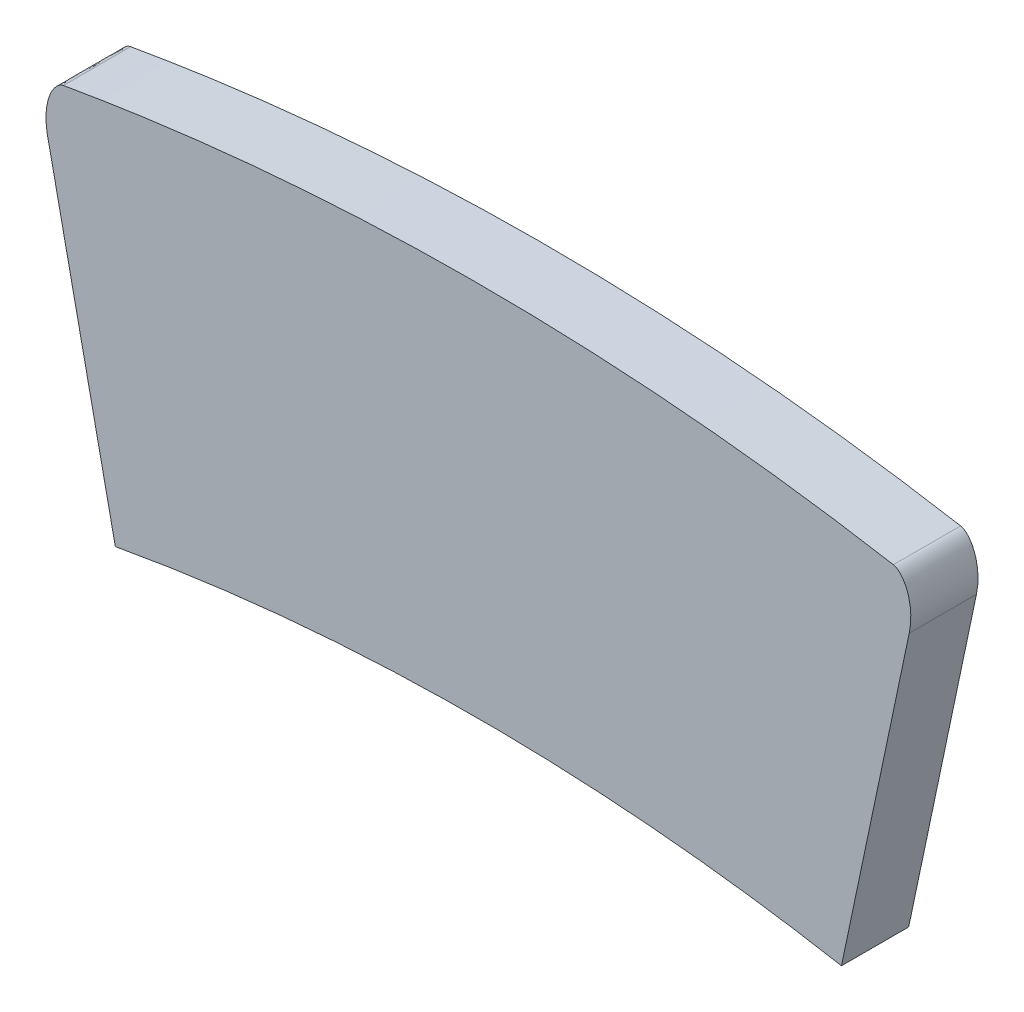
ISO-10303-21;
HEADER;
FILE_DESCRIPTION(('STEP AP214'),'2;1');
FILE_NAME('part.step','',(''),(''),'','','');
FILE_SCHEMA(('AUTOMOTIVE_DESIGN { 1 0 10303 214 1 1 1 1 }'));
ENDSEC;
DATA;
#1=APPLICATION_CONTEXT('core data for automotive mechanical design processes');
#2=APPLICATION_PROTOCOL_DEFINITION('international standard','automotive_design',2000,#1);
#3=PRODUCT_CONTEXT('',#1,'mechanical');
#4=PRODUCT('Part','Part','',(#3));
#5=PRODUCT_RELATED_PRODUCT_CATEGORY('part','',(#4));
#6=PRODUCT_DEFINITION_FORMATION('','',#4);
#7=PRODUCT_DEFINITION_CONTEXT('part definition',#1,'design');
#8=PRODUCT_DEFINITION('design','',#6,#7);
#9=PRODUCT_DEFINITION_SHAPE('','',#8);
#10=(LENGTH_UNIT() NAMED_UNIT(*) SI_UNIT(.MILLI.,.METRE.));
#11=(NAMED_UNIT(*) PLANE_ANGLE_UNIT() SI_UNIT($,.RADIAN.));
#12=(NAMED_UNIT(*) SI_UNIT($,.STERADIAN.) SOLID_ANGLE_UNIT());
#13=UNCERTAINTY_MEASURE_WITH_UNIT(LENGTH_MEASURE(1.E-05),#10,'distance_accuracy_value','');
#14=(GEOMETRIC_REPRESENTATION_CONTEXT(3) GLOBAL_UNCERTAINTY_ASSIGNED_CONTEXT((#13)) GLOBAL_UNIT_ASSIGNED_CONTEXT((#10,
#11,#12)) REPRESENTATION_CONTEXT('',''));
#15=CARTESIAN_POINT('',(0.,0.,0.));
#16=DIRECTION('',(0.,0.,1.));
#17=DIRECTION('',(1.,0.,0.));
#18=AXIS2_PLACEMENT_3D('',#15,#16,#17);
#19=CARTESIAN_POINT('',(0.618103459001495,4.44375735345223,0.8));
#20=CARTESIAN_POINT('',(-1.02369367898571,4.73126754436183,0.8));
#21=CARTESIAN_POINT('',(-2.66815252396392,4.87138414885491,0.8));
#22=CARTESIAN_POINT('',(-5.13862677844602,4.87190780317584,0.8));
#23=CARTESIAN_POINT('',(-5.96275434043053,4.836855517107,0.8));
#24=CARTESIAN_POINT('',(-7.61230750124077,4.69487139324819,0.8));
#25=CARTESIAN_POINT('',(-8.43972731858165,4.58750501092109,0.8));
#26=CARTESIAN_POINT('',(-9.2605834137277,4.44375735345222,0.8));
#27=B_SPLINE_CURVE_WITH_KNOTS('',3,(#19,#20,#21,#22,#23,#24,#25,#26),.UNSPECIFIED.,.F.,.F.,(4,2,
2,4),(0.,0.5,0.75,1.),.UNSPECIFIED.);
#28=DIRECTION('',(0.,0.,-1.));
#29=VECTOR('',#28,1.);
#30=SURFACE_OF_LINEAR_EXTRUSION('',#27,#29);
#31=CARTESIAN_POINT('',(0.618103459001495,4.44375735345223,0.));
#32=CARTESIAN_POINT('',(-1.02369367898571,4.73126754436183,0.));
#33=CARTESIAN_POINT('',(-2.66815252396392,4.87138414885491,0.));
#34=CARTESIAN_POINT('',(-5.13862677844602,4.87190780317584,0.));
#35=CARTESIAN_POINT('',(-5.96275434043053,4.836855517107,0.));
#36=CARTESIAN_POINT('',(-7.61230750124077,4.69487139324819,0.));
#37=CARTESIAN_POINT('',(-8.43972731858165,4.58750501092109,0.));
#38=CARTESIAN_POINT('',(-9.2605834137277,4.44375735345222,0.));
#39=B_SPLINE_CURVE_WITH_KNOTS('',3,(#31,#32,#33,#34,#35,#36,#37,#38),.UNSPECIFIED.,.F.,.F.,(4,2,
2,4),(0.,0.5,0.75,1.),.UNSPECIFIED.);
#40=CARTESIAN_POINT('',(0.618103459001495,4.44375735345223,0.));
#41=VERTEX_POINT('',#40);
#42=CARTESIAN_POINT('',(-9.2605834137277,4.44375735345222,0.));
#43=VERTEX_POINT('',#42);
#44=EDGE_CURVE('E89',#41,#43,#39,.T.);
#45=ORIENTED_EDGE('',*,*,#44,.T.);
#46=DIRECTION('',(0.,0.,-1.));
#47=VECTOR('',#46,1.);
#48=CARTESIAN_POINT('',(-9.2605834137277,4.44375735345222,0.8));
#49=LINE('',#48,#47);
#50=CARTESIAN_POINT('',(-9.2605834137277,4.44375735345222,0.8));
#51=VERTEX_POINT('',#50);
#52=EDGE_CURVE('E11',#51,#43,#49,.T.);
#53=ORIENTED_EDGE('',*,*,#52,.F.);
#54=CARTESIAN_POINT('',(0.618103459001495,4.44375735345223,0.8));
#55=VERTEX_POINT('',#54);
#56=EDGE_CURVE('E128',#55,#51,#27,.T.);
#57=ORIENTED_EDGE('',*,*,#56,.F.);
#58=DIRECTION('',(0.,0.,-1.));
#59=VECTOR('',#58,1.);
#60=CARTESIAN_POINT('',(0.618103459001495,4.44375735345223,0.8));
#61=LINE('',#60,#59);
#62=EDGE_CURVE('E102',#55,#41,#61,.T.);
#63=ORIENTED_EDGE('',*,*,#62,.T.);
#64=EDGE_LOOP('',(#45,#53,#57,#63));
#65=FACE_BOUND('',#64,.T.);
#66=ADVANCED_FACE('F32',(#65),#30,.F.);
#67=CARTESIAN_POINT('',(-9.2605834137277,4.44375735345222,0.8));
#68=CARTESIAN_POINT('',(-9.28960021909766,4.4386759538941,0.8));
#69=CARTESIAN_POINT('',(-9.31430015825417,4.4214263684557,0.8));
#70=CARTESIAN_POINT('',(-9.35603905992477,4.38139064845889,0.8));
#71=CARTESIAN_POINT('',(-9.37341120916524,4.35793934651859,0.8));
#72=CARTESIAN_POINT('',(-9.41786058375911,4.28408422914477,0.8));
#73=CARTESIAN_POINT('',(-9.4375241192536,4.2290328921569,0.8));
#74=CARTESIAN_POINT('',(-9.47510636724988,4.06149221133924,0.8));
#75=CARTESIAN_POINT('',(-9.47283970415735,3.94497121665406,0.8));
#76=CARTESIAN_POINT('',(-9.44906227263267,3.83200658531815,0.8));
#77=B_SPLINE_CURVE_WITH_KNOTS('',3,(#67,#68,#69,#70,#71,#72,#73,#74,#75,#76),.UNSPECIFIED.,.F.,
.F.,(4,2,2,2,4),(0.,0.125000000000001,0.250000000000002,0.500000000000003,1.),.UNSPECIFIED.);
#78=DIRECTION('',(0.,0.,-1.));
#79=VECTOR('',#78,1.);
#80=SURFACE_OF_LINEAR_EXTRUSION('',#77,#79);
#81=CARTESIAN_POINT('',(-9.2605834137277,4.44375735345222,0.));
#82=CARTESIAN_POINT('',(-9.28960021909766,4.4386759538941,0.));
#83=CARTESIAN_POINT('',(-9.31430015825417,4.4214263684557,0.));
#84=CARTESIAN_POINT('',(-9.35603905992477,4.38139064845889,0.));
#85=CARTESIAN_POINT('',(-9.37341120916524,4.35793934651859,0.));
#86=CARTESIAN_POINT('',(-9.41786058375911,4.28408422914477,0.));
#87=CARTESIAN_POINT('',(-9.4375241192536,4.2290328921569,0.));
#88=CARTESIAN_POINT('',(-9.47510636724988,4.06149221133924,0.));
#89=CARTESIAN_POINT('',(-9.47283970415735,3.94497121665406,0.));
#90=CARTESIAN_POINT('',(-9.44906227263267,3.83200658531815,0.));
#91=B_SPLINE_CURVE_WITH_KNOTS('',3,(#81,#82,#83,#84,#85,#86,#87,#88,#89,#90),.UNSPECIFIED.,.F.,
.F.,(4,2,2,2,4),(0.,0.125000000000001,0.250000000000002,0.500000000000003,1.),.UNSPECIFIED.);
#92=CARTESIAN_POINT('',(-9.44906227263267,3.83200658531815,0.));
#93=VERTEX_POINT('',#92);
#94=EDGE_CURVE('E85',#43,#93,#91,.T.);
#95=ORIENTED_EDGE('',*,*,#94,.T.);
#96=DIRECTION('',(0.,0.,-1.));
#97=VECTOR('',#96,1.);
#98=CARTESIAN_POINT('',(-9.44906227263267,3.83200658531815,0.8));
#99=LINE('',#98,#97);
#100=CARTESIAN_POINT('',(-9.44906227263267,3.83200658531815,0.8));
#101=VERTEX_POINT('',#100);
#102=EDGE_CURVE('E40',#101,#93,#99,.T.);
#103=ORIENTED_EDGE('',*,*,#102,.F.);
#104=EDGE_CURVE('E98',#51,#101,#77,.T.);
#105=ORIENTED_EDGE('',*,*,#104,.F.);
#106=ORIENTED_EDGE('',*,*,#52,.T.);
#107=EDGE_LOOP('',(#95,#103,#105,#106));
#108=FACE_BOUND('',#107,.T.);
#109=ADVANCED_FACE('F97',(#108),#80,.F.);
#110=CARTESIAN_POINT('',(-8.64247995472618,0.,0.8));
#111=DIRECTION('',(0.978557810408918,0.20597235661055,0.));
#112=DIRECTION('',(-0.20597235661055,0.978557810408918,0.));
#113=AXIS2_PLACEMENT_3D('',#110,#111,#112);
#114=PLANE('',#113);
#115=DIRECTION('',(0.20597235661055,-0.978557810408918,0.));
#116=VECTOR('',#115,1.);
#117=CARTESIAN_POINT('',(-8.64247995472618,0.,0.));
#118=LINE('',#117,#116);
#119=CARTESIAN_POINT('',(-8.64247995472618,0.,0.));
#120=VERTEX_POINT('',#119);
#121=EDGE_CURVE('E91',#93,#120,#118,.T.);
#122=ORIENTED_EDGE('',*,*,#121,.T.);
#123=DIRECTION('',(0.,0.,-1.));
#124=VECTOR('',#123,1.);
#125=CARTESIAN_POINT('',(-8.64247995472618,0.,0.8));
#126=LINE('',#125,#124);
#127=CARTESIAN_POINT('',(-8.64247995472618,0.,0.8));
#128=VERTEX_POINT('',#127);
#129=EDGE_CURVE('E242',#128,#120,#126,.T.);
#130=ORIENTED_EDGE('',*,*,#129,.F.);
#131=DIRECTION('',(0.20597235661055,-0.978557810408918,0.));
#132=VECTOR('',#131,1.);
#133=CARTESIAN_POINT('',(-8.64247995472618,0.,0.8));
#134=LINE('',#133,#132);
#135=EDGE_CURVE('E143',#101,#128,#134,.T.);
#136=ORIENTED_EDGE('',*,*,#135,.F.);
#137=ORIENTED_EDGE('',*,*,#102,.T.);
#138=EDGE_LOOP('',(#122,#130,#136,#137));
#139=FACE_BOUND('',#138,.T.);
#140=ADVANCED_FACE('F150',(#139),#114,.F.);
#141=CARTESIAN_POINT('',(-8.64247995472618,0.,0.8));
#142=CARTESIAN_POINT('',(-7.2092722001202,0.260381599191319,0.8));
#143=CARTESIAN_POINT('',(-5.77151805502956,0.387712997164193,0.8));
#144=CARTESIAN_POINT('',(-3.60838526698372,0.38844151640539,0.8));
#145=CARTESIAN_POINT('',(-2.88624821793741,0.356703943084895,0.8));
#146=CARTESIAN_POINT('',(-1.43973218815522,0.227618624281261,0.8));
#147=CARTESIAN_POINT('',(-0.716551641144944,0.130181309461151,0.8));
#148=CARTESIAN_POINT('',(0.,0.,0.8));
#149=B_SPLINE_CURVE_WITH_KNOTS('',3,(#141,#142,#143,#144,#145,#146,#147,#148),.UNSPECIFIED.,.F.,
.F.,(4,2,2,4),(0.,0.5,0.75,1.),.UNSPECIFIED.);
#150=DIRECTION('',(0.,0.,-1.));
#151=VECTOR('',#150,1.);
#152=SURFACE_OF_LINEAR_EXTRUSION('',#149,#151);
#153=CARTESIAN_POINT('',(-8.64247995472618,0.,0.));
#154=CARTESIAN_POINT('',(-7.2092722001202,0.260381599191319,0.));
#155=CARTESIAN_POINT('',(-5.77151805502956,0.387712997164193,0.));
#156=CARTESIAN_POINT('',(-3.60838526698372,0.38844151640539,0.));
#157=CARTESIAN_POINT('',(-2.88624821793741,0.356703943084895,0.));
#158=CARTESIAN_POINT('',(-1.43973218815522,0.227618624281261,0.));
#159=CARTESIAN_POINT('',(-0.716551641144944,0.130181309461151,0.));
#160=CARTESIAN_POINT('',(0.,0.,0.));
#161=B_SPLINE_CURVE_WITH_KNOTS('',3,(#153,#154,#155,#156,#157,#158,#159,#160),.UNSPECIFIED.,.F.,
.F.,(4,2,2,4),(0.,0.5,0.75,1.),.UNSPECIFIED.);
#162=CARTESIAN_POINT('',(0.,0.,0.));
#163=VERTEX_POINT('',#162);
#164=EDGE_CURVE('E116',#120,#163,#161,.T.);
#165=ORIENTED_EDGE('',*,*,#164,.T.);
#166=DIRECTION('',(0.,0.,-1.));
#167=VECTOR('',#166,1.);
#168=CARTESIAN_POINT('',(0.,0.,0.8));
#169=LINE('',#168,#167);
#170=CARTESIAN_POINT('',(0.,0.,0.8));
#171=VERTEX_POINT('',#170);
#172=EDGE_CURVE('E241',#171,#163,#169,.T.);
#173=ORIENTED_EDGE('',*,*,#172,.F.);
#174=EDGE_CURVE('E160',#128,#171,#149,.T.);
#175=ORIENTED_EDGE('',*,*,#174,.F.);
#176=ORIENTED_EDGE('',*,*,#129,.T.);
#177=EDGE_LOOP('',(#165,#173,#175,#176));
#178=FACE_BOUND('',#177,.T.);
#179=ADVANCED_FACE('F153',(#178),#152,.F.);
#180=CARTESIAN_POINT('',(0.806582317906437,3.83200658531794,0.8));
#181=DIRECTION('',(-0.978557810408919,0.205972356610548,0.));
#182=DIRECTION('',(-0.205972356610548,-0.978557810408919,0.));
#183=AXIS2_PLACEMENT_3D('',#180,#181,#182);
#184=PLANE('',#183);
#185=DIRECTION('',(0.205972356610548,0.978557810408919,0.));
#186=VECTOR('',#185,1.);
#187=CARTESIAN_POINT('',(0.806582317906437,3.83200658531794,0.));
#188=LINE('',#187,#186);
#189=CARTESIAN_POINT('',(0.806582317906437,3.83200658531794,0.));
#190=VERTEX_POINT('',#189);
#191=EDGE_CURVE('E120',#163,#190,#188,.T.);
#192=ORIENTED_EDGE('',*,*,#191,.T.);
#193=DIRECTION('',(0.,0.,-1.));
#194=VECTOR('',#193,1.);
#195=CARTESIAN_POINT('',(0.806582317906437,3.83200658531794,0.8));
#196=LINE('',#195,#194);
#197=CARTESIAN_POINT('',(0.806582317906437,3.83200658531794,0.8));
#198=VERTEX_POINT('',#197);
#199=EDGE_CURVE('E239',#198,#190,#196,.T.);
#200=ORIENTED_EDGE('',*,*,#199,.F.);
#201=DIRECTION('',(0.205972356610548,0.978557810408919,0.));
#202=VECTOR('',#201,1.);
#203=CARTESIAN_POINT('',(0.806582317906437,3.83200658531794,0.8));
#204=LINE('',#203,#202);
#205=EDGE_CURVE('E52',#171,#198,#204,.T.);
#206=ORIENTED_EDGE('',*,*,#205,.F.);
#207=ORIENTED_EDGE('',*,*,#172,.T.);
#208=EDGE_LOOP('',(#192,#200,#206,#207));
#209=FACE_BOUND('',#208,.T.);
#210=ADVANCED_FACE('F157',(#209),#184,.F.);
#211=CARTESIAN_POINT('',(0.806582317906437,3.83200658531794,0.8));
#212=CARTESIAN_POINT('',(0.830357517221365,3.94496061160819,0.8));
#213=CARTESIAN_POINT('',(0.832719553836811,4.06090736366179,0.8));
#214=CARTESIAN_POINT('',(0.795164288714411,4.22891392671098,0.8));
#215=CARTESIAN_POINT('',(0.775444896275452,4.28394099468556,0.8));
#216=CARTESIAN_POINT('',(0.730986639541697,4.35788531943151,0.8));
#217=CARTESIAN_POINT('',(0.713559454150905,4.38139935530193,0.8));
#218=CARTESIAN_POINT('',(0.671868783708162,4.42137692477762,0.8));
#219=CARTESIAN_POINT('',(0.646907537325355,4.43871320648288,0.8));
#220=CARTESIAN_POINT('',(0.618103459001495,4.44375735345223,0.8));
#221=B_SPLINE_CURVE_WITH_KNOTS('',3,(#211,#212,#213,#214,#215,#216,#217,#218,#219,#220),
.UNSPECIFIED.,.F.,.F.,(4,2,2,2,4),(0.,0.499999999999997,0.749999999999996,0.874999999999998,1.),.UNSPECIFIED.);
#222=DIRECTION('',(0.,0.,-1.));
#223=VECTOR('',#222,1.);
#224=SURFACE_OF_LINEAR_EXTRUSION('',#221,#223);
#225=CARTESIAN_POINT('',(0.806582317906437,3.83200658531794,0.));
#226=CARTESIAN_POINT('',(0.830357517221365,3.94496061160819,0.));
#227=CARTESIAN_POINT('',(0.832719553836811,4.06090736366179,0.));
#228=CARTESIAN_POINT('',(0.795164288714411,4.22891392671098,0.));
#229=CARTESIAN_POINT('',(0.775444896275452,4.28394099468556,0.));
#230=CARTESIAN_POINT('',(0.730986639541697,4.35788531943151,0.));
#231=CARTESIAN_POINT('',(0.713559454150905,4.38139935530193,0.));
#232=CARTESIAN_POINT('',(0.671868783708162,4.42137692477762,0.));
#233=CARTESIAN_POINT('',(0.646907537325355,4.43871320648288,0.));
#234=CARTESIAN_POINT('',(0.618103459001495,4.44375735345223,0.));
#235=B_SPLINE_CURVE_WITH_KNOTS('',3,(#225,#226,#227,#228,#229,#230,#231,#232,#233,#234),
.UNSPECIFIED.,.F.,.F.,(4,2,2,2,4),(0.,0.499999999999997,0.749999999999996,0.874999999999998,1.),.UNSPECIFIED.);
#236=EDGE_CURVE('E125',#190,#41,#235,.T.);
#237=ORIENTED_EDGE('',*,*,#236,.T.);
#238=ORIENTED_EDGE('',*,*,#62,.F.);
#239=EDGE_CURVE('E47',#198,#55,#221,.T.);
#240=ORIENTED_EDGE('',*,*,#239,.F.);
#241=ORIENTED_EDGE('',*,*,#199,.T.);
#242=EDGE_LOOP('',(#237,#238,#240,#241));
#243=FACE_BOUND('',#242,.T.);
#244=ADVANCED_FACE('F177',(#243),#224,.F.);
#245=CARTESIAN_POINT('',(-4.31513536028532,4.87173325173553,0.8));
#246=DIRECTION('',(0.,0.,1.));
#247=DIRECTION('',(1.,0.,0.));
#248=AXIS2_PLACEMENT_3D('',#245,#246,#247);
#249=PLANE('',#248);
#250=ORIENTED_EDGE('',*,*,#56,.T.);
#251=ORIENTED_EDGE('',*,*,#104,.T.);
#252=ORIENTED_EDGE('',*,*,#135,.T.);
#253=ORIENTED_EDGE('',*,*,#174,.T.);
#254=ORIENTED_EDGE('',*,*,#205,.T.);
#255=ORIENTED_EDGE('',*,*,#239,.T.);
#256=EDGE_LOOP('',(#250,#251,#252,#253,#254,#255));
#257=FACE_BOUND('',#256,.T.);
#258=ADVANCED_FACE('F180',(#257),#249,.T.);
#259=CARTESIAN_POINT('',(-4.31513536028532,4.87173325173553,0.));
#260=DIRECTION('',(0.,0.,1.));
#261=DIRECTION('',(1.,0.,0.));
#262=AXIS2_PLACEMENT_3D('',#259,#260,#261);
#263=PLANE('',#262);
#264=ORIENTED_EDGE('',*,*,#44,.F.);
#265=ORIENTED_EDGE('',*,*,#236,.F.);
#266=ORIENTED_EDGE('',*,*,#191,.F.);
#267=ORIENTED_EDGE('',*,*,#164,.F.);
#268=ORIENTED_EDGE('',*,*,#121,.F.);
#269=ORIENTED_EDGE('',*,*,#94,.F.);
#270=EDGE_LOOP('',(#264,#265,#266,#267,#268,#269));
#271=FACE_BOUND('',#270,.T.);
#272=ADVANCED_FACE('F86',(#271),#263,.F.);
#273=CLOSED_SHELL('',(#66,#109,#140,#179,#210,#244,#258,#272));
#274=MANIFOLD_SOLID_BREP('B2',#273);
#275=ADVANCED_BREP_SHAPE_REPRESENTATION('',(#18,#274),#14);
#276=SHAPE_DEFINITION_REPRESENTATION(#9,#275);
ENDSEC;
END-ISO-10303-21;
